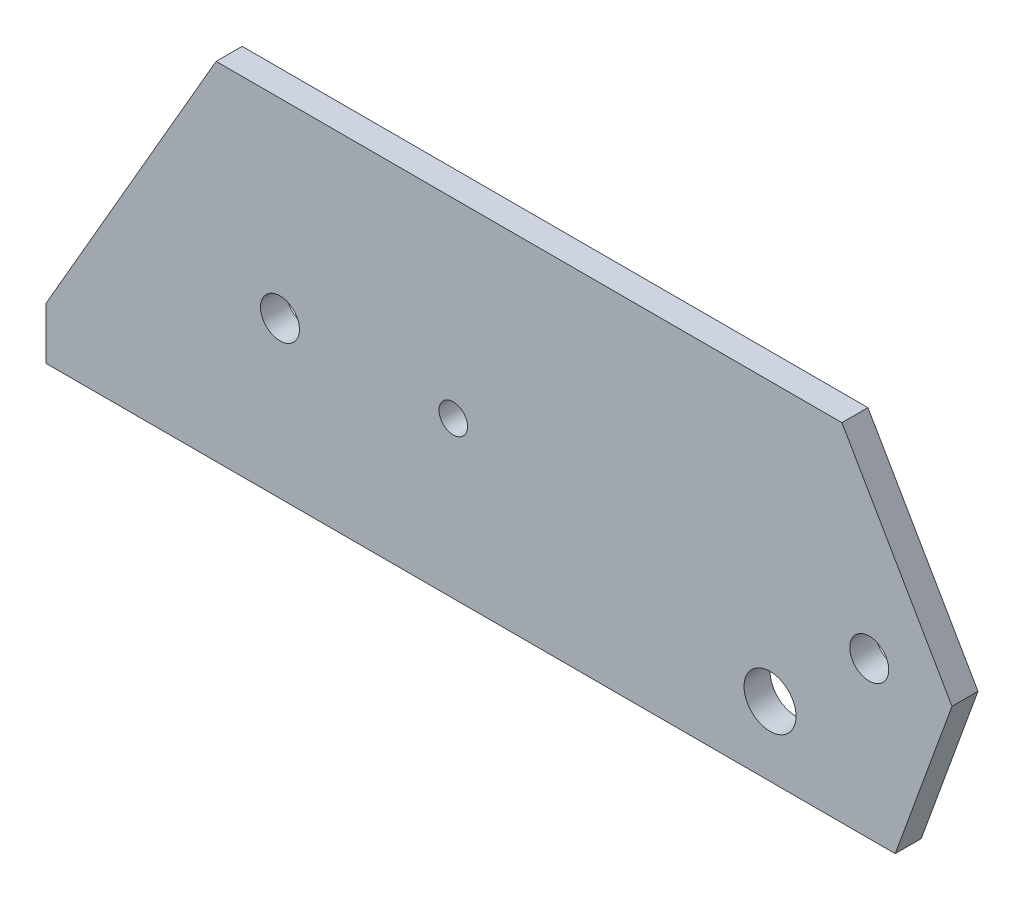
from build123d import *

# Parameters (mm, degrees)
SKETCH1_R         = 2.25
SKETCH1_R_2       = 3
EXTRUDE1_DEPTH    = 3
M4_TAPPED_HOLE1_D = 3.3


with BuildPart() as part:
    # Sketch1 → Extrude1 (new body)
    with BuildSketch(Plane.XY):
        Polygon((0, 0), (0, 6), (19.629909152, 40), (91.849758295, 40), (104.551464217, 18), (98, 0), align=None)
        with Locations((27, 18)):
            Circle(SKETCH1_R, mode=Mode.SUBTRACT)
        with Locations((83.551464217, 8)):
            Circle(SKETCH1_R_2, mode=Mode.SUBTRACT)
        with Locations((95, 18)):
            Circle(SKETCH1_R, mode=Mode.SUBTRACT)
    extrude(amount=EXTRUDE1_DEPTH)

    # M4 Tapped Hole1 (through all)
    with Locations(Plane(origin=(47, 18, 3), x_dir=(1, 0, 0), z_dir=(0, 0, 1))):
        with Locations((0, 0)):
            Hole(M4_TAPPED_HOLE1_D / 2)


solid = part.part
